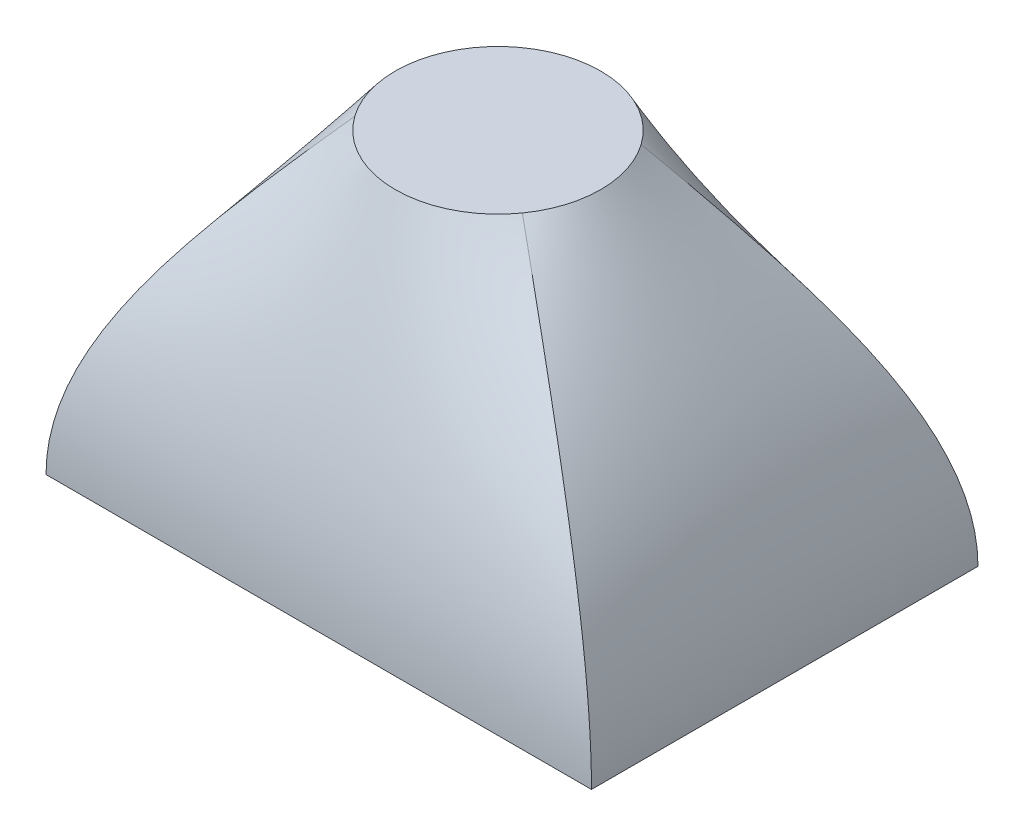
ISO-10303-21;
HEADER;
FILE_DESCRIPTION(('STEP AP214'),'2;1');
FILE_NAME('part.step','',(''),(''),'','','');
FILE_SCHEMA(('AUTOMOTIVE_DESIGN { 1 0 10303 214 1 1 1 1 }'));
ENDSEC;
DATA;
#1=APPLICATION_CONTEXT('core data for automotive mechanical design processes');
#2=APPLICATION_PROTOCOL_DEFINITION('international standard','automotive_design',2000,#1);
#3=PRODUCT_CONTEXT('',#1,'mechanical');
#4=PRODUCT('Part','Part','',(#3));
#5=PRODUCT_RELATED_PRODUCT_CATEGORY('part','',(#4));
#6=PRODUCT_DEFINITION_FORMATION('','',#4);
#7=PRODUCT_DEFINITION_CONTEXT('part definition',#1,'design');
#8=PRODUCT_DEFINITION('design','',#6,#7);
#9=PRODUCT_DEFINITION_SHAPE('','',#8);
#10=(LENGTH_UNIT() NAMED_UNIT(*) SI_UNIT(.MILLI.,.METRE.));
#11=(NAMED_UNIT(*) PLANE_ANGLE_UNIT() SI_UNIT($,.RADIAN.));
#12=(NAMED_UNIT(*) SI_UNIT($,.STERADIAN.) SOLID_ANGLE_UNIT());
#13=UNCERTAINTY_MEASURE_WITH_UNIT(LENGTH_MEASURE(1.E-05),#10,'distance_accuracy_value','');
#14=(GEOMETRIC_REPRESENTATION_CONTEXT(3) GLOBAL_UNCERTAINTY_ASSIGNED_CONTEXT((#13)) GLOBAL_UNIT_ASSIGNED_CONTEXT((#10,
#11,#12)) REPRESENTATION_CONTEXT('',''));
#15=CARTESIAN_POINT('',(0.,0.,0.));
#16=DIRECTION('',(0.,0.,1.));
#17=DIRECTION('',(1.,0.,0.));
#18=AXIS2_PLACEMENT_3D('',#15,#16,#17);
#19=CARTESIAN_POINT('',(0.,50.8,0.));
#20=DIRECTION('',(0.,1.,0.));
#21=DIRECTION('',(0.,0.,1.));
#22=AXIS2_PLACEMENT_3D('',#19,#20,#21);
#23=PLANE('',#22);
#24=CARTESIAN_POINT('',(0.,50.8,0.));
#25=DIRECTION('',(0.,1.,0.));
#26=DIRECTION('',(0.,0.,1.));
#27=AXIS2_PLACEMENT_3D('',#24,#25,#26);
#28=CIRCLE('',#27,15.8479106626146);
#29=CARTESIAN_POINT('',(-12.9308307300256,50.8,9.16241720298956));
#30=VERTEX_POINT('',#29);
#31=CARTESIAN_POINT('',(12.9308307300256,50.8,9.16241720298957));
#32=VERTEX_POINT('',#31);
#33=EDGE_CURVE('E165',#30,#32,#28,.T.);
#34=ORIENTED_EDGE('',*,*,#33,.T.);
#35=CARTESIAN_POINT('',(12.9308307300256,50.8,-9.16241720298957));
#36=VERTEX_POINT('',#35);
#37=EDGE_CURVE('E174',#32,#36,#28,.T.);
#38=ORIENTED_EDGE('',*,*,#37,.T.);
#39=CARTESIAN_POINT('',(-12.9308307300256,50.8,-9.16241720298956));
#40=VERTEX_POINT('',#39);
#41=EDGE_CURVE('E179',#36,#40,#28,.T.);
#42=ORIENTED_EDGE('',*,*,#41,.T.);
#43=EDGE_CURVE('E156',#40,#30,#28,.T.);
#44=ORIENTED_EDGE('',*,*,#43,.T.);
#45=EDGE_LOOP('',(#34,#38,#42,#44));
#46=FACE_BOUND('',#45,.T.);
#47=ADVANCED_FACE('F106',(#46),#23,.T.);
#48=CARTESIAN_POINT('',(-39.6738382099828,0.,30.0559380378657));
#49=DIRECTION('',(0.,1.,0.));
#50=DIRECTION('',(0.,0.,1.));
#51=AXIS2_PLACEMENT_3D('',#48,#49,#50);
#52=PLANE('',#51);
#53=DIRECTION('',(0.,0.,1.));
#54=VECTOR('',#53,1.);
#55=CARTESIAN_POINT('',(-39.6738382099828,0.,-29.5750430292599));
#56=LINE('',#55,#54);
#57=CARTESIAN_POINT('',(-39.6738382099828,0.,-29.5750430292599));
#58=VERTEX_POINT('',#57);
#59=CARTESIAN_POINT('',(-39.6738382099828,0.,30.0559380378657));
#60=VERTEX_POINT('',#59);
#61=EDGE_CURVE('E159',#58,#60,#56,.T.);
#62=ORIENTED_EDGE('',*,*,#61,.F.);
#63=DIRECTION('',(-1.,0.,0.));
#64=VECTOR('',#63,1.);
#65=CARTESIAN_POINT('',(-39.6738382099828,0.,-29.5750430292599));
#66=LINE('',#65,#64);
#67=CARTESIAN_POINT('',(44.4827882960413,0.,-29.5750430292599));
#68=VERTEX_POINT('',#67);
#69=EDGE_CURVE('E12',#68,#58,#66,.T.);
#70=ORIENTED_EDGE('',*,*,#69,.F.);
#71=DIRECTION('',(0.,0.,-1.));
#72=VECTOR('',#71,1.);
#73=CARTESIAN_POINT('',(44.4827882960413,0.,-29.5750430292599));
#74=LINE('',#73,#72);
#75=CARTESIAN_POINT('',(44.4827882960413,0.,30.0559380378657));
#76=VERTEX_POINT('',#75);
#77=EDGE_CURVE('E118',#76,#68,#74,.T.);
#78=ORIENTED_EDGE('',*,*,#77,.F.);
#79=DIRECTION('',(1.,0.,0.));
#80=VECTOR('',#79,1.);
#81=CARTESIAN_POINT('',(-39.6738382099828,0.,30.0559380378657));
#82=LINE('',#81,#80);
#83=EDGE_CURVE('E126',#60,#76,#82,.T.);
#84=ORIENTED_EDGE('',*,*,#83,.F.);
#85=EDGE_LOOP('',(#62,#70,#78,#84));
#86=FACE_BOUND('',#85,.T.);
#87=ADVANCED_FACE('F108',(#86),#52,.F.);
#88=CARTESIAN_POINT('',(-39.6738382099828,0.,-29.5750430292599));
#89=CARTESIAN_POINT('',(-39.6738382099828,18.2790956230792,-29.5750430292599));
#90=CARTESIAN_POINT('',(-26.3023344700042,34.5395478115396,-19.3687301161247));
#91=CARTESIAN_POINT('',(-12.9308307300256,50.8,-9.16241720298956));
#92=CARTESIAN_POINT('',(-39.6738382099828,0.,-9.69804934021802));
#93=CARTESIAN_POINT('',(-39.6738382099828,18.2953743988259,-9.69804934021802));
#94=CARTESIAN_POINT('',(-28.2465609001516,34.547687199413,-6.68636532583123));
#95=CARTESIAN_POINT('',(-16.8192835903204,50.8,-3.67468131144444));
#96=CARTESIAN_POINT('',(-39.6738382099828,0.,10.1789443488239));
#97=CARTESIAN_POINT('',(-39.6738382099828,18.3116531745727,10.1789443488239));
#98=CARTESIAN_POINT('',(-28.2465609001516,34.5558265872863,6.92681283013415));
#99=CARTESIAN_POINT('',(-16.8192835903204,50.8,3.67468131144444));
#100=CARTESIAN_POINT('',(-39.6738382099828,0.,30.0559380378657));
#101=CARTESIAN_POINT('',(-39.6738382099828,18.3279319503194,30.0559380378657));
#102=CARTESIAN_POINT('',(-26.3023344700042,34.5639659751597,19.6091776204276));
#103=CARTESIAN_POINT('',(-12.9308307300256,50.8,9.16241720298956));
#104=B_SPLINE_SURFACE_WITH_KNOTS('',3,3,((#88,#89,#90,#91),(#92,#93,#94,#95),(#96,#97,#98,#99),
(#100,#101,#102,#103)),.UNSPECIFIED.,.F.,.F.,.F.,(4,4),(4,4),(0.,1.),(0.,1.),.UNSPECIFIED.);
#105=CARTESIAN_POINT('',(-39.6738382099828,0.,30.0559380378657));
#106=CARTESIAN_POINT('',(-39.6738382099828,18.3279319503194,30.0559380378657));
#107=CARTESIAN_POINT('',(-26.3023344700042,34.5639659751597,19.6091776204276));
#108=CARTESIAN_POINT('',(-12.9308307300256,50.8,9.16241720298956));
#109=B_SPLINE_CURVE_WITH_KNOTS('',3,(#105,#106,#107,#108),.UNSPECIFIED.,.F.,.F.,(4,4),(0.,1.),.UNSPECIFIED.);
#110=EDGE_CURVE('E152',#60,#30,#109,.T.);
#111=CARTESIAN_POINT('',(-39.6738382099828,0.,-29.5750430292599));
#112=CARTESIAN_POINT('',(-39.6738382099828,18.2790956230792,-29.5750430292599));
#113=CARTESIAN_POINT('',(-26.3023344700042,34.5395478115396,-19.3687301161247));
#114=CARTESIAN_POINT('',(-12.9308307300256,50.8,-9.16241720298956));
#115=B_SPLINE_CURVE_WITH_KNOTS('',3,(#111,#112,#113,#114),.UNSPECIFIED.,.F.,.F.,(4,4),(0.,1.),.UNSPECIFIED.);
#116=EDGE_CURVE('E162',#40,#58,#115,.F.);
#117=ORIENTED_EDGE('',*,*,#61,.T.);
#118=ORIENTED_EDGE('',*,*,#110,.T.);
#119=ORIENTED_EDGE('',*,*,#43,.F.);
#120=ORIENTED_EDGE('',*,*,#116,.T.);
#121=EDGE_LOOP('',(#117,#118,#119,#120));
#122=FACE_BOUND('',#121,.T.);
#123=ADVANCED_FACE('F154',(#122),#104,.T.);
#124=CARTESIAN_POINT('',(-39.6738382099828,0.,30.0559380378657));
#125=CARTESIAN_POINT('',(-39.6738382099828,18.3279319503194,30.0559380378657));
#126=CARTESIAN_POINT('',(-26.3023344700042,34.5639659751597,19.6091776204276));
#127=CARTESIAN_POINT('',(-12.9308307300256,50.8,9.16241720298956));
#128=CARTESIAN_POINT('',(-25.6477337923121,0.,30.0559380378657));
#129=CARTESIAN_POINT('',(-25.6477337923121,17.0282842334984,30.0559380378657));
#130=CARTESIAN_POINT('',(-17.8037947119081,33.9141421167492,21.7056318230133));
#131=CARTESIAN_POINT('',(-9.95985563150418,50.8,13.3553256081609));
#132=CARTESIAN_POINT('',(-11.6216293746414,0.,30.0559380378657));
#133=CARTESIAN_POINT('',(-11.6216293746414,15.7286365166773,30.0559380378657));
#134=CARTESIAN_POINT('',(-8.38021023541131,33.2643182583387,22.9519243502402));
#135=CARTESIAN_POINT('',(-5.13879109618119,50.8,15.8479106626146));
#136=CARTESIAN_POINT('',(16.4305794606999,0.,30.0559380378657));
#137=CARTESIAN_POINT('',(16.4305794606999,15.9539175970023,30.0559380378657));
#138=CARTESIAN_POINT('',(10.7846852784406,33.3769587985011,22.9519243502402));
#139=CARTESIAN_POINT('',(5.13879109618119,50.8,15.8479106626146));
#140=CARTESIAN_POINT('',(30.4566838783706,0.,30.0559380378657));
#141=CARTESIAN_POINT('',(30.4566838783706,17.4788463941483,30.0559380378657));
#142=CARTESIAN_POINT('',(20.2082697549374,34.1394231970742,21.7056318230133));
#143=CARTESIAN_POINT('',(9.95985563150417,50.8,13.3553256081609));
#144=CARTESIAN_POINT('',(44.4827882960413,0.,30.0559380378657));
#145=CARTESIAN_POINT('',(44.4827882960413,19.0037751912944,30.0559380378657));
#146=CARTESIAN_POINT('',(28.7068095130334,34.9018875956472,19.6091776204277));
#147=CARTESIAN_POINT('',(12.9308307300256,50.8,9.16241720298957));
#148=B_SPLINE_SURFACE_WITH_KNOTS('',3,3,((#124,#125,#126,#127),(#128,#129,#130,#131),(#132,#133,
#134,#135),(#136,#137,#138,#139),(#140,#141,#142,#143),(#144,#145,#146,#147)),.UNSPECIFIED.,.F.,
.F.,.F.,(4,2,4),(4,4),(0.,0.5,1.),(0.,1.),.UNSPECIFIED.);
#149=CARTESIAN_POINT('',(44.4827882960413,0.,30.0559380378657));
#150=CARTESIAN_POINT('',(44.4827882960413,19.0037751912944,30.0559380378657));
#151=CARTESIAN_POINT('',(28.7068095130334,34.9018875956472,19.6091776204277));
#152=CARTESIAN_POINT('',(12.9308307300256,50.8,9.16241720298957));
#153=B_SPLINE_CURVE_WITH_KNOTS('',3,(#149,#150,#151,#152),.UNSPECIFIED.,.F.,.F.,(4,4),(0.,1.),.UNSPECIFIED.);
#154=EDGE_CURVE('E169',#76,#32,#153,.T.);
#155=ORIENTED_EDGE('',*,*,#83,.T.);
#156=ORIENTED_EDGE('',*,*,#154,.T.);
#157=ORIENTED_EDGE('',*,*,#33,.F.);
#158=ORIENTED_EDGE('',*,*,#110,.F.);
#159=EDGE_LOOP('',(#155,#156,#157,#158));
#160=FACE_BOUND('',#159,.T.);
#161=ADVANCED_FACE('F167',(#160),#148,.T.);
#162=CARTESIAN_POINT('',(44.4827882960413,0.,-29.5750430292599));
#163=CARTESIAN_POINT('',(44.4827882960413,18.956680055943,-29.5750430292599));
#164=CARTESIAN_POINT('',(28.7068095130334,34.8783400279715,-19.3687301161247));
#165=CARTESIAN_POINT('',(12.9308307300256,50.8,-9.16241720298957));
#166=CARTESIAN_POINT('',(30.4566838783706,0.,-29.5750430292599));
#167=CARTESIAN_POINT('',(30.4566838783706,17.436340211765,-29.5750430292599));
#168=CARTESIAN_POINT('',(20.2082697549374,34.1181701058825,-21.4651843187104));
#169=CARTESIAN_POINT('',(9.95985563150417,50.8,-13.3553256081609));
#170=CARTESIAN_POINT('',(16.4305794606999,0.,-29.5750430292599));
#171=CARTESIAN_POINT('',(16.4305794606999,15.9160003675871,-29.5750430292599));
#172=CARTESIAN_POINT('',(10.7846852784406,33.3580001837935,-22.7114768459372));
#173=CARTESIAN_POINT('',(5.13879109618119,50.8,-15.8479106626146));
#174=CARTESIAN_POINT('',(-11.6216293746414,0.,-29.5750430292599));
#175=CARTESIAN_POINT('',(-11.6216293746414,15.6901388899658,-29.5750430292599));
#176=CARTESIAN_POINT('',(-8.3802102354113,33.2450694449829,-22.7114768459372));
#177=CARTESIAN_POINT('',(-5.13879109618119,50.8,-15.8479106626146));
#178=CARTESIAN_POINT('',(-25.6477337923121,0.,-29.5750430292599));
#179=CARTESIAN_POINT('',(-25.6477337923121,16.9846172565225,-29.5750430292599));
#180=CARTESIAN_POINT('',(-17.8037947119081,33.8923086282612,-21.4651843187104));
#181=CARTESIAN_POINT('',(-9.95985563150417,50.8,-13.3553256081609));
#182=CARTESIAN_POINT('',(-39.6738382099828,0.,-29.5750430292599));
#183=CARTESIAN_POINT('',(-39.6738382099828,18.2790956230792,-29.5750430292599));
#184=CARTESIAN_POINT('',(-26.3023344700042,34.5395478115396,-19.3687301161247));
#185=CARTESIAN_POINT('',(-12.9308307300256,50.8,-9.16241720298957));
#186=B_SPLINE_SURFACE_WITH_KNOTS('',3,3,((#162,#163,#164,#165),(#166,#167,#168,#169),(#170,#171,
#172,#173),(#174,#175,#176,#177),(#178,#179,#180,#181),(#182,#183,#184,#185)),.UNSPECIFIED.,.F.,
.F.,.F.,(4,2,4),(4,4),(0.,0.5,1.),(0.,1.),.UNSPECIFIED.);
#187=CARTESIAN_POINT('',(44.4827882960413,0.,-29.5750430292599));
#188=CARTESIAN_POINT('',(44.4827882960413,18.956680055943,-29.5750430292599));
#189=CARTESIAN_POINT('',(28.7068095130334,34.8783400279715,-19.3687301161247));
#190=CARTESIAN_POINT('',(12.9308307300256,50.8,-9.16241720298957));
#191=B_SPLINE_CURVE_WITH_KNOTS('',3,(#187,#188,#189,#190),.UNSPECIFIED.,.F.,.F.,(4,4),(0.,1.),.UNSPECIFIED.);
#192=EDGE_CURVE('E173',#68,#36,#191,.T.);
#193=ORIENTED_EDGE('',*,*,#69,.T.);
#194=ORIENTED_EDGE('',*,*,#116,.F.);
#195=ORIENTED_EDGE('',*,*,#41,.F.);
#196=ORIENTED_EDGE('',*,*,#192,.F.);
#197=EDGE_LOOP('',(#193,#194,#195,#196));
#198=FACE_BOUND('',#197,.T.);
#199=ADVANCED_FACE('F224',(#198),#186,.T.);
#200=CARTESIAN_POINT('',(44.4827882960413,0.,30.0559380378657));
#201=CARTESIAN_POINT('',(44.4827882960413,19.0037751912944,30.0559380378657));
#202=CARTESIAN_POINT('',(28.7068095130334,34.9018875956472,19.6091776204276));
#203=CARTESIAN_POINT('',(12.9308307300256,50.8,9.16241720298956));
#204=CARTESIAN_POINT('',(44.4827882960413,0.,10.1789443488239));
#205=CARTESIAN_POINT('',(44.4827882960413,18.9880768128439,10.1789443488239));
#206=CARTESIAN_POINT('',(30.6510359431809,34.894038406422,6.92681283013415));
#207=CARTESIAN_POINT('',(16.8192835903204,50.8,3.67468131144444));
#208=CARTESIAN_POINT('',(44.4827882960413,0.,-9.69804934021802));
#209=CARTESIAN_POINT('',(44.4827882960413,18.9723784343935,-9.69804934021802));
#210=CARTESIAN_POINT('',(30.6510359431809,34.8861892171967,-6.68636532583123));
#211=CARTESIAN_POINT('',(16.8192835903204,50.8,-3.67468131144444));
#212=CARTESIAN_POINT('',(44.4827882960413,0.,-29.5750430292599));
#213=CARTESIAN_POINT('',(44.4827882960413,18.956680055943,-29.5750430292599));
#214=CARTESIAN_POINT('',(28.7068095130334,34.8783400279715,-19.3687301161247));
#215=CARTESIAN_POINT('',(12.9308307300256,50.8,-9.16241720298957));
#216=B_SPLINE_SURFACE_WITH_KNOTS('',3,3,((#200,#201,#202,#203),(#204,#205,#206,#207),(#208,#209,
#210,#211),(#212,#213,#214,#215)),.UNSPECIFIED.,.F.,.F.,.F.,(4,4),(4,4),(0.,1.),(0.,1.),.UNSPECIFIED.);
#217=ORIENTED_EDGE('',*,*,#77,.T.);
#218=ORIENTED_EDGE('',*,*,#192,.T.);
#219=ORIENTED_EDGE('',*,*,#37,.F.);
#220=ORIENTED_EDGE('',*,*,#154,.F.);
#221=EDGE_LOOP('',(#217,#218,#219,#220));
#222=FACE_BOUND('',#221,.T.);
#223=ADVANCED_FACE('F208',(#222),#216,.T.);
#224=CLOSED_SHELL('',(#47,#87,#123,#161,#199,#223));
#225=MANIFOLD_SOLID_BREP('B2',#224);
#226=ADVANCED_BREP_SHAPE_REPRESENTATION('',(#18,#225),#14);
#227=SHAPE_DEFINITION_REPRESENTATION(#9,#226);
ENDSEC;
END-ISO-10303-21;
